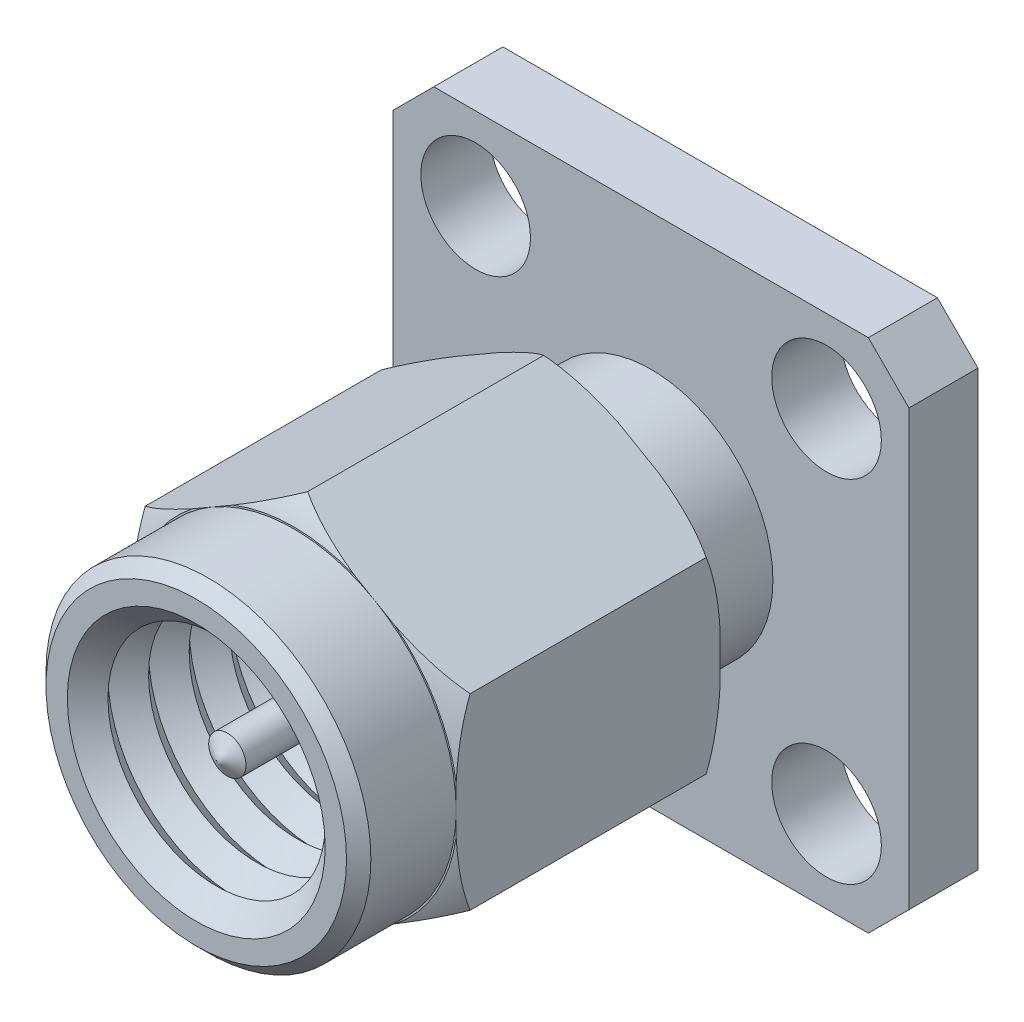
from build123d import *

# Parameters (mm, degrees)
EXTRUDE_1_DEPTH     = 1.7
SKETCH_3_R          = 3.7
EXTRUDE_2_DEPTH     = 6.5
HOLE_WIZARD_M2_51_D = 2.7


with BuildPart() as part:
    # Sketch 1 → Revolve 1 (revolve)
    with BuildSketch(Plane(origin=(0, 0, 0), x_dir=(0, 0, -1), z_dir=(1, 0, 0)), mode=Mode.PRIVATE) as revolve_1_sk:
        Polygon((2, 0), (2, 0.635), (0.2, 0.635), (0.2, 2.05), (0, 2.05), (0, 3), (-4, 3), (-4, 4), (-12.6, 4), (-12.9, 3.7), (-12.9, 3.175), (-12.4, 2.675), (-11.9, 3.175), (-11.4, 2.675), (-10.9, 3.175), (-10.4, 2.675), (-9.9, 3.175), (-9.4, 2.675), (-8.9, 3.175), (-8.4, 2.675), (-7.9, 3.175), (-7.4, 2.675), (-6.9, 3.175), (-6.4, 2.675), (-5.9, 3.175), (-5.9, 0.46), (-12.134418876, 0.46), (-12.4, 0), align=None)
    revolve(revolve_1_sk.sketch.rotate(Axis((0, 0, 12.4), (0, 0, -1)), 90), axis=Axis((0, 0, 12.4), (0, 0, -1)))

    # Sketch 2 → Extrude 1 (add)
    with BuildSketch(Plane.XY):
        Polygon((-6.35, 5.35), (-5.35, 6.35), (5.35, 6.35), (6.35, 5.35), (6.35, -5.35), (5.35, -6.35), (-5.35, -6.35), (-6.35, -5.35), align=None)
    extrude(amount=EXTRUDE_1_DEPTH)

    # Sketch 3 → Extrude 2 (add)
    with BuildSketch(Plane(origin=(0, 0, 4), x_dir=(-1, 0, 0), z_dir=(0, 0, -1))):
        Polygon((-4, 2.309401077), (-4, -2.309401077), (0, -4.618802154), (4, -2.309401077), (4, 2.309401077), (0, 4.618802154), align=None)
        Circle(SKETCH_3_R, mode=Mode.SUBTRACT)
    extrude(amount=-EXTRUDE_2_DEPTH)

    # Sketch 4 → Cut-Revolve 1 (revolve, cut)
    with BuildSketch(Plane(origin=(0, 0, 0), x_dir=(0, 0, -1), z_dir=(1, 0, 0)), mode=Mode.PRIVATE) as cut_revolve_1_sk:
        with BuildLine():
            Line((-10.5, 4.041451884), (-10.5, 5.5))
            Line((-10.5, 5.5), (-8.75, 5.5))
            ThreePointArc((-8.75, 5.5), (-9.800791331, 4.981644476), (-10.5, 4.041451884))
        make_face()
        with BuildLine():
            Line((-4, 5.5), (-5.75, 5.5))
            ThreePointArc((-5.75, 5.5), (-4.699208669, 4.981644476), (-4, 4.041451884))
            Line((-4, 4.041451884), (-4, 5.5))
        make_face()
    revolve(cut_revolve_1_sk.sketch.rotate(Axis((0, 0, 0), (0, 0, 1)), 90), axis=Axis((0, 0, 0), (0, 0, 1)), mode=Mode.SUBTRACT)

    # Hole Wizard M2_51 (through all)
    with Locations(Plane.XY.offset(1.7)):
        with Locations((-4.32, 4.32), (4.32, 4.32), (-4.32, -4.32), (4.32, -4.32)):
            Hole(HOLE_WIZARD_M2_51_D / 2)


solid = part.part
